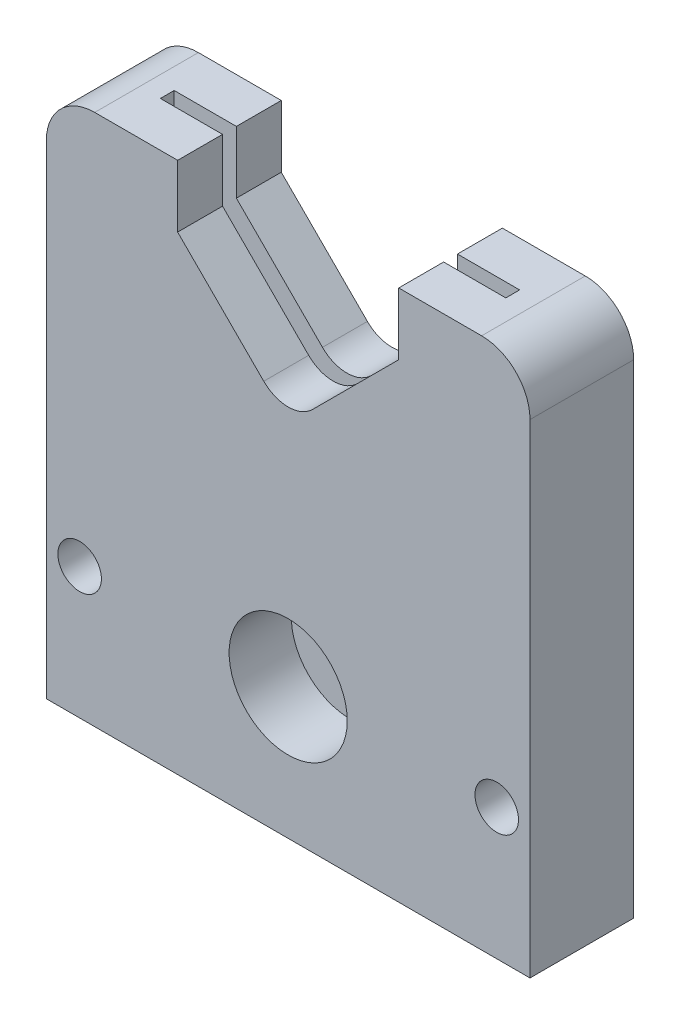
ISO-10303-21;
HEADER;
FILE_DESCRIPTION(('STEP AP214'),'2;1');
FILE_NAME('part.step','',(''),(''),'','','');
FILE_SCHEMA(('AUTOMOTIVE_DESIGN { 1 0 10303 214 1 1 1 1 }'));
ENDSEC;
DATA;
#1=APPLICATION_CONTEXT('core data for automotive mechanical design processes');
#2=APPLICATION_PROTOCOL_DEFINITION('international standard','automotive_design',2000,#1);
#3=PRODUCT_CONTEXT('',#1,'mechanical');
#4=PRODUCT('Part','Part','',(#3));
#5=PRODUCT_RELATED_PRODUCT_CATEGORY('part','',(#4));
#6=PRODUCT_DEFINITION_FORMATION('','',#4);
#7=PRODUCT_DEFINITION_CONTEXT('part definition',#1,'design');
#8=PRODUCT_DEFINITION('design','',#6,#7);
#9=PRODUCT_DEFINITION_SHAPE('','',#8);
#10=(LENGTH_UNIT() NAMED_UNIT(*) SI_UNIT(.MILLI.,.METRE.));
#11=(NAMED_UNIT(*) PLANE_ANGLE_UNIT() SI_UNIT($,.RADIAN.));
#12=(NAMED_UNIT(*) SI_UNIT($,.STERADIAN.) SOLID_ANGLE_UNIT());
#13=UNCERTAINTY_MEASURE_WITH_UNIT(LENGTH_MEASURE(1.E-05),#10,'distance_accuracy_value','');
#14=(GEOMETRIC_REPRESENTATION_CONTEXT(3) GLOBAL_UNCERTAINTY_ASSIGNED_CONTEXT((#13)) GLOBAL_UNIT_ASSIGNED_CONTEXT((#10,
#11,#12)) REPRESENTATION_CONTEXT('',''));
#15=CARTESIAN_POINT('',(0.,0.,0.));
#16=DIRECTION('',(0.,0.,1.));
#17=DIRECTION('',(1.,0.,0.));
#18=AXIS2_PLACEMENT_3D('',#15,#16,#17);
#19=CARTESIAN_POINT('',(51.,70.,140.15615246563));
#20=DIRECTION('',(-1.,0.,0.));
#21=DIRECTION('',(0.,0.,1.));
#22=AXIS2_PLACEMENT_3D('',#19,#20,#21);
#23=PLANE('',#22);
#24=DIRECTION('',(0.,-1.,0.));
#25=VECTOR('',#24,1.);
#26=CARTESIAN_POINT('',(51.,70.,6.50000000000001));
#27=LINE('',#26,#25);
#28=CARTESIAN_POINT('',(51.,70.,6.5));
#29=VERTEX_POINT('',#28);
#30=CARTESIAN_POINT('',(51.,61.,6.50000000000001));
#31=VERTEX_POINT('',#30);
#32=EDGE_CURVE('E265',#29,#31,#27,.T.);
#33=ORIENTED_EDGE('',*,*,#32,.F.);
#34=DIRECTION('',(0.,0.,-1.));
#35=VECTOR('',#34,1.);
#36=CARTESIAN_POINT('',(51.,70.,140.15615246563));
#37=LINE('',#36,#35);
#38=CARTESIAN_POINT('',(51.,70.,0.));
#39=VERTEX_POINT('',#38);
#40=EDGE_CURVE('E326',#29,#39,#37,.T.);
#41=ORIENTED_EDGE('',*,*,#40,.T.);
#42=DIRECTION('',(0.,-1.,0.));
#43=VECTOR('',#42,1.);
#44=CARTESIAN_POINT('',(51.,0.,0.));
#45=LINE('',#44,#43);
#46=CARTESIAN_POINT('',(51.,61.,0.));
#47=VERTEX_POINT('',#46);
#48=EDGE_CURVE('E412',#39,#47,#45,.T.);
#49=ORIENTED_EDGE('',*,*,#48,.T.);
#50=DIRECTION('',(0.,0.,-1.));
#51=VECTOR('',#50,1.);
#52=CARTESIAN_POINT('',(51.,61.,140.15615246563));
#53=LINE('',#52,#51);
#54=EDGE_CURVE('E321',#31,#47,#53,.T.);
#55=ORIENTED_EDGE('',*,*,#54,.F.);
#56=EDGE_LOOP('',(#33,#41,#49,#55));
#57=FACE_BOUND('',#56,.T.);
#58=ADVANCED_FACE('F41',(#57),#23,.T.);
#59=CARTESIAN_POINT('',(38.5355339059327,48.5355339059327,140.15615246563));
#60=DIRECTION('',(-0.707106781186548,0.707106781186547,0.));
#61=DIRECTION('',(-0.707106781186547,-0.707106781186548,0.));
#62=AXIS2_PLACEMENT_3D('',#59,#60,#61);
#63=PLANE('',#62);
#64=DIRECTION('',(-0.707106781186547,-0.707106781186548,0.));
#65=VECTOR('',#64,1.);
#66=CARTESIAN_POINT('',(38.5355339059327,48.5355339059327,6.50000000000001));
#67=LINE('',#66,#65);
#68=CARTESIAN_POINT('',(38.5355339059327,48.5355339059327,6.50000000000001));
#69=VERTEX_POINT('',#68);
#70=EDGE_CURVE('E262',#31,#69,#67,.T.);
#71=ORIENTED_EDGE('',*,*,#70,.F.);
#72=ORIENTED_EDGE('',*,*,#54,.T.);
#73=DIRECTION('',(-0.707106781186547,-0.707106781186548,0.));
#74=VECTOR('',#73,1.);
#75=CARTESIAN_POINT('',(-5.,4.99999999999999,0.));
#76=LINE('',#75,#74);
#77=CARTESIAN_POINT('',(38.5355339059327,48.5355339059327,0.));
#78=VERTEX_POINT('',#77);
#79=EDGE_CURVE('E408',#47,#78,#76,.T.);
#80=ORIENTED_EDGE('',*,*,#79,.T.);
#81=DIRECTION('',(0.,0.,-1.));
#82=VECTOR('',#81,1.);
#83=CARTESIAN_POINT('',(38.5355339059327,48.5355339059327,140.15615246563));
#84=LINE('',#83,#82);
#85=EDGE_CURVE('E316',#69,#78,#84,.T.);
#86=ORIENTED_EDGE('',*,*,#85,.F.);
#87=EDGE_LOOP('',(#71,#72,#80,#86));
#88=FACE_BOUND('',#87,.T.);
#89=ADVANCED_FACE('F473',(#88),#63,.T.);
#90=CARTESIAN_POINT('',(35.,52.0710678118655,140.15615246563));
#91=DIRECTION('',(0.,0.,-1.));
#92=DIRECTION('',(-1.,0.,0.));
#93=AXIS2_PLACEMENT_3D('',#90,#91,#92);
#94=CYLINDRICAL_SURFACE('',#93,5.);
#95=CARTESIAN_POINT('',(35.,52.0710678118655,6.50000000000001));
#96=DIRECTION('',(0.,0.,-1.));
#97=DIRECTION('',(-1.,0.,0.));
#98=AXIS2_PLACEMENT_3D('',#95,#96,#97);
#99=CIRCLE('',#98,5.);
#100=CARTESIAN_POINT('',(31.4644660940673,48.5355339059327,6.50000000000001));
#101=VERTEX_POINT('',#100);
#102=EDGE_CURVE('E259',#69,#101,#99,.T.);
#103=ORIENTED_EDGE('',*,*,#102,.F.);
#104=ORIENTED_EDGE('',*,*,#85,.T.);
#105=CARTESIAN_POINT('',(35.,52.0710678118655,0.));
#106=DIRECTION('',(0.,0.,1.));
#107=DIRECTION('',(1.,0.,0.));
#108=AXIS2_PLACEMENT_3D('',#105,#106,#107);
#109=CIRCLE('',#108,5.);
#110=CARTESIAN_POINT('',(31.4644660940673,48.5355339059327,0.));
#111=VERTEX_POINT('',#110);
#112=EDGE_CURVE('E404',#78,#111,#109,.F.);
#113=ORIENTED_EDGE('',*,*,#112,.T.);
#114=DIRECTION('',(0.,0.,-1.));
#115=VECTOR('',#114,1.);
#116=CARTESIAN_POINT('',(31.4644660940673,48.5355339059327,140.15615246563));
#117=LINE('',#116,#115);
#118=EDGE_CURVE('E311',#101,#111,#117,.T.);
#119=ORIENTED_EDGE('',*,*,#118,.F.);
#120=EDGE_LOOP('',(#103,#104,#113,#119));
#121=FACE_BOUND('',#120,.T.);
#122=ADVANCED_FACE('F469',(#121),#94,.F.);
#123=CARTESIAN_POINT('',(19.,61.,140.15615246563));
#124=DIRECTION('',(0.707106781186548,0.707106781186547,0.));
#125=DIRECTION('',(-0.707106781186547,0.707106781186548,0.));
#126=AXIS2_PLACEMENT_3D('',#123,#124,#125);
#127=PLANE('',#126);
#128=DIRECTION('',(-0.707106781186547,0.707106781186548,0.));
#129=VECTOR('',#128,1.);
#130=CARTESIAN_POINT('',(19.,61.,6.50000000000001));
#131=LINE('',#130,#129);
#132=CARTESIAN_POINT('',(19.,61.,6.50000000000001));
#133=VERTEX_POINT('',#132);
#134=EDGE_CURVE('E256',#101,#133,#131,.T.);
#135=ORIENTED_EDGE('',*,*,#134,.F.);
#136=ORIENTED_EDGE('',*,*,#118,.T.);
#137=DIRECTION('',(-0.707106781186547,0.707106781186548,0.));
#138=VECTOR('',#137,1.);
#139=CARTESIAN_POINT('',(40.,40.,0.));
#140=LINE('',#139,#138);
#141=CARTESIAN_POINT('',(19.,61.,0.));
#142=VERTEX_POINT('',#141);
#143=EDGE_CURVE('E400',#111,#142,#140,.T.);
#144=ORIENTED_EDGE('',*,*,#143,.T.);
#145=DIRECTION('',(0.,0.,-1.));
#146=VECTOR('',#145,1.);
#147=CARTESIAN_POINT('',(19.,61.,140.15615246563));
#148=LINE('',#147,#146);
#149=EDGE_CURVE('E305',#133,#142,#148,.T.);
#150=ORIENTED_EDGE('',*,*,#149,.F.);
#151=EDGE_LOOP('',(#135,#136,#144,#150));
#152=FACE_BOUND('',#151,.T.);
#153=ADVANCED_FACE('F463',(#152),#127,.T.);
#154=CARTESIAN_POINT('',(19.,70.,140.15615246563));
#155=DIRECTION('',(1.,0.,0.));
#156=DIRECTION('',(0.,0.,-1.));
#157=AXIS2_PLACEMENT_3D('',#154,#155,#156);
#158=PLANE('',#157);
#159=DIRECTION('',(0.,1.,0.));
#160=VECTOR('',#159,1.);
#161=CARTESIAN_POINT('',(19.,70.,6.50000000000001));
#162=LINE('',#161,#160);
#163=CARTESIAN_POINT('',(19.,70.,6.5));
#164=VERTEX_POINT('',#163);
#165=EDGE_CURVE('E11',#133,#164,#162,.T.);
#166=ORIENTED_EDGE('',*,*,#165,.F.);
#167=ORIENTED_EDGE('',*,*,#149,.T.);
#168=DIRECTION('',(0.,1.,0.));
#169=VECTOR('',#168,1.);
#170=CARTESIAN_POINT('',(19.,0.,0.));
#171=LINE('',#170,#169);
#172=CARTESIAN_POINT('',(19.,70.,0.));
#173=VERTEX_POINT('',#172);
#174=EDGE_CURVE('E396',#142,#173,#171,.T.);
#175=ORIENTED_EDGE('',*,*,#174,.T.);
#176=DIRECTION('',(0.,0.,-1.));
#177=VECTOR('',#176,1.);
#178=CARTESIAN_POINT('',(19.,70.,140.15615246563));
#179=LINE('',#178,#177);
#180=EDGE_CURVE('E306',#164,#173,#179,.T.);
#181=ORIENTED_EDGE('',*,*,#180,.F.);
#182=EDGE_LOOP('',(#166,#167,#175,#181));
#183=FACE_BOUND('',#182,.T.);
#184=ADVANCED_FACE('F459',(#183),#158,.T.);
#185=CARTESIAN_POINT('',(0.,70.,15.));
#186=DIRECTION('',(0.,-1.,0.));
#187=DIRECTION('',(0.,0.,-1.));
#188=AXIS2_PLACEMENT_3D('',#185,#186,#187);
#189=PLANE('',#188);
#190=ORIENTED_EDGE('',*,*,#40,.F.);
#191=DIRECTION('',(-1.,0.,0.));
#192=VECTOR('',#191,1.);
#193=CARTESIAN_POINT('',(60.,70.,6.5));
#194=LINE('',#193,#192);
#195=CARTESIAN_POINT('',(60.,70.,6.5));
#196=VERTEX_POINT('',#195);
#197=EDGE_CURVE('E217',#196,#29,#194,.T.);
#198=ORIENTED_EDGE('',*,*,#197,.F.);
#199=DIRECTION('',(0.,0.,-1.));
#200=VECTOR('',#199,1.);
#201=CARTESIAN_POINT('',(60.,70.,8.5));
#202=LINE('',#201,#200);
#203=CARTESIAN_POINT('',(60.,70.,8.5));
#204=VERTEX_POINT('',#203);
#205=EDGE_CURVE('E232',#204,#196,#202,.T.);
#206=ORIENTED_EDGE('',*,*,#205,.F.);
#207=DIRECTION('',(1.,0.,0.));
#208=VECTOR('',#207,1.);
#209=CARTESIAN_POINT('',(60.,70.,8.5));
#210=LINE('',#209,#208);
#211=CARTESIAN_POINT('',(51.,70.,8.5));
#212=VERTEX_POINT('',#211);
#213=EDGE_CURVE('E229',#212,#204,#210,.T.);
#214=ORIENTED_EDGE('',*,*,#213,.F.);
#215=CARTESIAN_POINT('',(51.,70.,15.));
#216=VERTEX_POINT('',#215);
#217=EDGE_CURVE('E327',#216,#212,#37,.T.);
#218=ORIENTED_EDGE('',*,*,#217,.F.);
#219=DIRECTION('',(-1.,0.,0.));
#220=VECTOR('',#219,1.);
#221=CARTESIAN_POINT('',(0.,70.,15.));
#222=LINE('',#221,#220);
#223=CARTESIAN_POINT('',(63.,70.,15.));
#224=VERTEX_POINT('',#223);
#225=EDGE_CURVE('E355',#224,#216,#222,.T.);
#226=ORIENTED_EDGE('',*,*,#225,.F.);
#227=DIRECTION('',(0.,0.,-1.));
#228=VECTOR('',#227,1.);
#229=CARTESIAN_POINT('',(63.,70.,15.));
#230=LINE('',#229,#228);
#231=CARTESIAN_POINT('',(63.,70.,0.));
#232=VERTEX_POINT('',#231);
#233=EDGE_CURVE('E358',#224,#232,#230,.T.);
#234=ORIENTED_EDGE('',*,*,#233,.T.);
#235=DIRECTION('',(-1.,0.,0.));
#236=VECTOR('',#235,1.);
#237=CARTESIAN_POINT('',(0.,70.,0.));
#238=LINE('',#237,#236);
#239=EDGE_CURVE('E350',#232,#39,#238,.T.);
#240=ORIENTED_EDGE('',*,*,#239,.T.);
#241=EDGE_LOOP('',(#190,#198,#206,#214,#218,#226,#234,#240));
#242=FACE_BOUND('',#241,.T.);
#243=ADVANCED_FACE('F481',(#242),#189,.F.);
#244=DIRECTION('',(0.,0.,1.));
#245=VECTOR('',#244,1.);
#246=CARTESIAN_POINT('',(10.,70.,8.5));
#247=LINE('',#246,#245);
#248=CARTESIAN_POINT('',(10.,70.,6.5));
#249=VERTEX_POINT('',#248);
#250=CARTESIAN_POINT('',(10.,70.,8.5));
#251=VERTEX_POINT('',#250);
#252=EDGE_CURVE('E199',#249,#251,#247,.T.);
#253=ORIENTED_EDGE('',*,*,#252,.F.);
#254=EDGE_CURVE('E220',#164,#249,#194,.T.);
#255=ORIENTED_EDGE('',*,*,#254,.F.);
#256=ORIENTED_EDGE('',*,*,#180,.T.);
#257=CARTESIAN_POINT('',(6.99999999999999,70.,0.));
#258=VERTEX_POINT('',#257);
#259=EDGE_CURVE('E365',#173,#258,#238,.T.);
#260=ORIENTED_EDGE('',*,*,#259,.T.);
#261=DIRECTION('',(0.,0.,-1.));
#262=VECTOR('',#261,1.);
#263=CARTESIAN_POINT('',(6.99999999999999,70.,15.));
#264=LINE('',#263,#262);
#265=CARTESIAN_POINT('',(6.99999999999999,70.,15.));
#266=VERTEX_POINT('',#265);
#267=EDGE_CURVE('E389',#258,#266,#264,.F.);
#268=ORIENTED_EDGE('',*,*,#267,.T.);
#269=CARTESIAN_POINT('',(19.,70.,15.));
#270=VERTEX_POINT('',#269);
#271=EDGE_CURVE('E354',#270,#266,#222,.T.);
#272=ORIENTED_EDGE('',*,*,#271,.F.);
#273=CARTESIAN_POINT('',(19.,70.,8.50000000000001));
#274=VERTEX_POINT('',#273);
#275=EDGE_CURVE('E301',#270,#274,#179,.T.);
#276=ORIENTED_EDGE('',*,*,#275,.T.);
#277=EDGE_CURVE('E57',#251,#274,#210,.T.);
#278=ORIENTED_EDGE('',*,*,#277,.F.);
#279=EDGE_LOOP('',(#253,#255,#256,#260,#268,#272,#276,#278));
#280=FACE_BOUND('',#279,.T.);
#281=ADVANCED_FACE('F437',(#280),#189,.F.);
#282=CARTESIAN_POINT('',(0.,0.,15.));
#283=DIRECTION('',(0.,0.,1.));
#284=DIRECTION('',(1.,0.,0.));
#285=AXIS2_PLACEMENT_3D('',#282,#283,#284);
#286=PLANE('',#285);
#287=CARTESIAN_POINT('',(35.,12.,15.));
#288=DIRECTION('',(0.,0.,1.));
#289=DIRECTION('',(1.,0.,0.));
#290=AXIS2_PLACEMENT_3D('',#287,#288,#289);
#291=CIRCLE('',#290,8.55);
#292=CARTESIAN_POINT('',(43.55,12.,15.));
#293=VERTEX_POINT('',#292);
#294=EDGE_CURVE('E284',#293,#293,#291,.T.);
#295=ORIENTED_EDGE('',*,*,#294,.F.);
#296=EDGE_LOOP('',(#295));
#297=FACE_BOUND('',#296,.T.);
#298=CARTESIAN_POINT('',(4.815,12.,15.));
#299=DIRECTION('',(0.,0.,1.));
#300=DIRECTION('',(1.,0.,0.));
#301=AXIS2_PLACEMENT_3D('',#298,#299,#300);
#302=CIRCLE('',#301,3.15);
#303=CARTESIAN_POINT('',(7.965,12.,15.));
#304=VERTEX_POINT('',#303);
#305=EDGE_CURVE('E293',#304,#304,#302,.T.);
#306=ORIENTED_EDGE('',*,*,#305,.F.);
#307=EDGE_LOOP('',(#306));
#308=FACE_BOUND('',#307,.T.);
#309=CARTESIAN_POINT('',(65.185,12.,15.));
#310=DIRECTION('',(0.,0.,1.));
#311=DIRECTION('',(1.,0.,0.));
#312=AXIS2_PLACEMENT_3D('',#309,#310,#311);
#313=CIRCLE('',#312,3.15);
#314=CARTESIAN_POINT('',(68.335,12.,15.));
#315=VERTEX_POINT('',#314);
#316=EDGE_CURVE('E289',#315,#315,#313,.T.);
#317=ORIENTED_EDGE('',*,*,#316,.F.);
#318=EDGE_LOOP('',(#317));
#319=FACE_BOUND('',#318,.T.);
#320=ORIENTED_EDGE('',*,*,#225,.T.);
#321=DIRECTION('',(0.,-1.,0.));
#322=VECTOR('',#321,1.);
#323=CARTESIAN_POINT('',(51.,0.,15.));
#324=LINE('',#323,#322);
#325=CARTESIAN_POINT('',(51.,61.,15.));
#326=VERTEX_POINT('',#325);
#327=EDGE_CURVE('E65',#216,#326,#324,.T.);
#328=ORIENTED_EDGE('',*,*,#327,.T.);
#329=DIRECTION('',(-0.707106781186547,-0.707106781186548,0.));
#330=VECTOR('',#329,1.);
#331=CARTESIAN_POINT('',(-5.,4.99999999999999,15.));
#332=LINE('',#331,#330);
#333=CARTESIAN_POINT('',(38.5355339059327,48.5355339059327,15.));
#334=VERTEX_POINT('',#333);
#335=EDGE_CURVE('E340',#326,#334,#332,.T.);
#336=ORIENTED_EDGE('',*,*,#335,.T.);
#337=CARTESIAN_POINT('',(35.,52.0710678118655,15.));
#338=DIRECTION('',(0.,0.,1.));
#339=DIRECTION('',(1.,0.,0.));
#340=AXIS2_PLACEMENT_3D('',#337,#338,#339);
#341=CIRCLE('',#340,5.);
#342=CARTESIAN_POINT('',(31.4644660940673,48.5355339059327,15.));
#343=VERTEX_POINT('',#342);
#344=EDGE_CURVE('E337',#334,#343,#341,.F.);
#345=ORIENTED_EDGE('',*,*,#344,.T.);
#346=DIRECTION('',(-0.707106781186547,0.707106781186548,0.));
#347=VECTOR('',#346,1.);
#348=CARTESIAN_POINT('',(40.,40.,15.));
#349=LINE('',#348,#347);
#350=CARTESIAN_POINT('',(19.,61.,15.));
#351=VERTEX_POINT('',#350);
#352=EDGE_CURVE('E334',#343,#351,#349,.T.);
#353=ORIENTED_EDGE('',*,*,#352,.T.);
#354=DIRECTION('',(0.,1.,0.));
#355=VECTOR('',#354,1.);
#356=CARTESIAN_POINT('',(19.,0.,15.));
#357=LINE('',#356,#355);
#358=EDGE_CURVE('E331',#351,#270,#357,.T.);
#359=ORIENTED_EDGE('',*,*,#358,.T.);
#360=ORIENTED_EDGE('',*,*,#271,.T.);
#361=CARTESIAN_POINT('',(6.99999999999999,63.,15.));
#362=DIRECTION('',(0.,0.,1.));
#363=DIRECTION('',(1.,0.,0.));
#364=AXIS2_PLACEMENT_3D('',#361,#362,#363);
#365=CIRCLE('',#364,7.);
#366=CARTESIAN_POINT('',(0.,63.,15.));
#367=VERTEX_POINT('',#366);
#368=EDGE_CURVE('E393',#266,#367,#365,.T.);
#369=ORIENTED_EDGE('',*,*,#368,.T.);
#370=DIRECTION('',(0.,-1.,0.));
#371=VECTOR('',#370,1.);
#372=CARTESIAN_POINT('',(0.,70.,15.));
#373=LINE('',#372,#371);
#374=CARTESIAN_POINT('',(0.,-7.,15.));
#375=VERTEX_POINT('',#374);
#376=EDGE_CURVE('E346',#367,#375,#373,.T.);
#377=ORIENTED_EDGE('',*,*,#376,.T.);
#378=DIRECTION('',(-1.,0.,0.));
#379=VECTOR('',#378,1.);
#380=CARTESIAN_POINT('',(0.,-7.,15.));
#381=LINE('',#380,#379);
#382=CARTESIAN_POINT('',(70.,-7.,15.));
#383=VERTEX_POINT('',#382);
#384=EDGE_CURVE('E280',#383,#375,#381,.T.);
#385=ORIENTED_EDGE('',*,*,#384,.F.);
#386=DIRECTION('',(0.,1.,0.));
#387=VECTOR('',#386,1.);
#388=CARTESIAN_POINT('',(70.,70.,15.));
#389=LINE('',#388,#387);
#390=CARTESIAN_POINT('',(70.,63.,15.));
#391=VERTEX_POINT('',#390);
#392=EDGE_CURVE('E349',#383,#391,#389,.T.);
#393=ORIENTED_EDGE('',*,*,#392,.T.);
#394=CARTESIAN_POINT('',(63.,63.,15.));
#395=DIRECTION('',(0.,0.,1.));
#396=DIRECTION('',(1.,0.,0.));
#397=AXIS2_PLACEMENT_3D('',#394,#395,#396);
#398=CIRCLE('',#397,7.);
#399=EDGE_CURVE('E378',#391,#224,#398,.T.);
#400=ORIENTED_EDGE('',*,*,#399,.T.);
#401=EDGE_LOOP('',(#320,#328,#336,#345,#353,#359,#360,#369,#377,#385,#393,#400));
#402=FACE_BOUND('',#401,.T.);
#403=ADVANCED_FACE('F435',(#297,#308,#319,#402),#286,.T.);
#404=CARTESIAN_POINT('',(0.,0.,0.));
#405=DIRECTION('',(0.,0.,1.));
#406=DIRECTION('',(1.,0.,0.));
#407=AXIS2_PLACEMENT_3D('',#404,#405,#406);
#408=PLANE('',#407);
#409=CARTESIAN_POINT('',(4.815,12.,0.));
#410=DIRECTION('',(0.,0.,1.));
#411=DIRECTION('',(1.,0.,0.));
#412=AXIS2_PLACEMENT_3D('',#409,#410,#411);
#413=CIRCLE('',#412,3.15);
#414=CARTESIAN_POINT('',(7.965,12.,0.));
#415=VERTEX_POINT('',#414);
#416=EDGE_CURVE('E419',#415,#415,#413,.T.);
#417=ORIENTED_EDGE('',*,*,#416,.T.);
#418=EDGE_LOOP('',(#417));
#419=FACE_BOUND('',#418,.T.);
#420=CARTESIAN_POINT('',(65.185,12.,0.));
#421=DIRECTION('',(0.,0.,1.));
#422=DIRECTION('',(1.,0.,0.));
#423=AXIS2_PLACEMENT_3D('',#420,#421,#422);
#424=CIRCLE('',#423,3.15);
#425=CARTESIAN_POINT('',(68.335,12.,0.));
#426=VERTEX_POINT('',#425);
#427=EDGE_CURVE('E297',#426,#426,#424,.T.);
#428=ORIENTED_EDGE('',*,*,#427,.T.);
#429=EDGE_LOOP('',(#428));
#430=FACE_BOUND('',#429,.T.);
#431=ORIENTED_EDGE('',*,*,#48,.F.);
#432=ORIENTED_EDGE('',*,*,#239,.F.);
#433=CARTESIAN_POINT('',(63.,63.,0.));
#434=DIRECTION('',(0.,0.,1.));
#435=DIRECTION('',(1.,0.,0.));
#436=AXIS2_PLACEMENT_3D('',#433,#434,#435);
#437=CIRCLE('',#436,7.);
#438=CARTESIAN_POINT('',(70.,63.,0.));
#439=VERTEX_POINT('',#438);
#440=EDGE_CURVE('E372',#232,#439,#437,.F.);
#441=ORIENTED_EDGE('',*,*,#440,.T.);
#442=DIRECTION('',(0.,1.,0.));
#443=VECTOR('',#442,1.);
#444=CARTESIAN_POINT('',(70.,70.,0.));
#445=LINE('',#444,#443);
#446=CARTESIAN_POINT('',(70.,-7.,0.));
#447=VERTEX_POINT('',#446);
#448=EDGE_CURVE('E361',#447,#439,#445,.T.);
#449=ORIENTED_EDGE('',*,*,#448,.F.);
#450=DIRECTION('',(1.,0.,0.));
#451=VECTOR('',#450,1.);
#452=CARTESIAN_POINT('',(0.,-7.,0.));
#453=LINE('',#452,#451);
#454=CARTESIAN_POINT('',(0.,-7.,0.));
#455=VERTEX_POINT('',#454);
#456=EDGE_CURVE('E272',#455,#447,#453,.T.);
#457=ORIENTED_EDGE('',*,*,#456,.F.);
#458=DIRECTION('',(0.,-1.,0.));
#459=VECTOR('',#458,1.);
#460=CARTESIAN_POINT('',(0.,70.,0.));
#461=LINE('',#460,#459);
#462=CARTESIAN_POINT('',(0.,63.,0.));
#463=VERTEX_POINT('',#462);
#464=EDGE_CURVE('E345',#463,#455,#461,.T.);
#465=ORIENTED_EDGE('',*,*,#464,.F.);
#466=CARTESIAN_POINT('',(6.99999999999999,63.,0.));
#467=DIRECTION('',(0.,0.,1.));
#468=DIRECTION('',(1.,0.,0.));
#469=AXIS2_PLACEMENT_3D('',#466,#467,#468);
#470=CIRCLE('',#469,7.);
#471=EDGE_CURVE('E385',#463,#258,#470,.F.);
#472=ORIENTED_EDGE('',*,*,#471,.T.);
#473=ORIENTED_EDGE('',*,*,#259,.F.);
#474=ORIENTED_EDGE('',*,*,#174,.F.);
#475=ORIENTED_EDGE('',*,*,#143,.F.);
#476=ORIENTED_EDGE('',*,*,#112,.F.);
#477=ORIENTED_EDGE('',*,*,#79,.F.);
#478=EDGE_LOOP('',(#431,#432,#441,#449,#457,#465,#472,#473,#474,#475,#476,#477));
#479=FACE_BOUND('',#478,.T.);
#480=ADVANCED_FACE('F456',(#419,#430,#479),#408,.F.);
#481=CARTESIAN_POINT('',(0.,70.,15.));
#482=DIRECTION('',(1.,0.,0.));
#483=DIRECTION('',(0.,1.,0.));
#484=AXIS2_PLACEMENT_3D('',#481,#482,#483);
#485=PLANE('',#484);
#486=ORIENTED_EDGE('',*,*,#376,.F.);
#487=DIRECTION('',(0.,0.,-1.));
#488=VECTOR('',#487,1.);
#489=CARTESIAN_POINT('',(0.,63.,15.));
#490=LINE('',#489,#488);
#491=EDGE_CURVE('E381',#367,#463,#490,.T.);
#492=ORIENTED_EDGE('',*,*,#491,.T.);
#493=ORIENTED_EDGE('',*,*,#464,.T.);
#494=DIRECTION('',(0.,0.,-1.));
#495=VECTOR('',#494,1.);
#496=CARTESIAN_POINT('',(0.,-7.,15.));
#497=LINE('',#496,#495);
#498=EDGE_CURVE('E268',#375,#455,#497,.T.);
#499=ORIENTED_EDGE('',*,*,#498,.F.);
#500=EDGE_LOOP('',(#486,#492,#493,#499));
#501=FACE_BOUND('',#500,.T.);
#502=ADVANCED_FACE('F542',(#501),#485,.F.);
#503=CARTESIAN_POINT('',(70.,70.,15.));
#504=DIRECTION('',(-1.,0.,0.));
#505=DIRECTION('',(0.,-1.,0.));
#506=AXIS2_PLACEMENT_3D('',#503,#504,#505);
#507=PLANE('',#506);
#508=ORIENTED_EDGE('',*,*,#448,.T.);
#509=DIRECTION('',(0.,0.,-1.));
#510=VECTOR('',#509,1.);
#511=CARTESIAN_POINT('',(70.,63.,15.));
#512=LINE('',#511,#510);
#513=EDGE_CURVE('E375',#439,#391,#512,.F.);
#514=ORIENTED_EDGE('',*,*,#513,.T.);
#515=ORIENTED_EDGE('',*,*,#392,.F.);
#516=DIRECTION('',(0.,0.,1.));
#517=VECTOR('',#516,1.);
#518=CARTESIAN_POINT('',(70.,-7.,15.));
#519=LINE('',#518,#517);
#520=EDGE_CURVE('E276',#447,#383,#519,.T.);
#521=ORIENTED_EDGE('',*,*,#520,.F.);
#522=EDGE_LOOP('',(#508,#514,#515,#521));
#523=FACE_BOUND('',#522,.T.);
#524=ADVANCED_FACE('F490',(#523),#507,.F.);
#525=CARTESIAN_POINT('',(63.,63.,15.));
#526=DIRECTION('',(0.,0.,-1.));
#527=DIRECTION('',(-1.,0.,0.));
#528=AXIS2_PLACEMENT_3D('',#525,#526,#527);
#529=CYLINDRICAL_SURFACE('',#528,7.);
#530=ORIENTED_EDGE('',*,*,#399,.F.);
#531=ORIENTED_EDGE('',*,*,#513,.F.);
#532=ORIENTED_EDGE('',*,*,#440,.F.);
#533=ORIENTED_EDGE('',*,*,#233,.F.);
#534=EDGE_LOOP('',(#530,#531,#532,#533));
#535=FACE_BOUND('',#534,.T.);
#536=ADVANCED_FACE('F492',(#535),#529,.T.);
#537=CARTESIAN_POINT('',(6.99999999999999,63.,15.));
#538=DIRECTION('',(0.,0.,-1.));
#539=DIRECTION('',(-1.,0.,0.));
#540=AXIS2_PLACEMENT_3D('',#537,#538,#539);
#541=CYLINDRICAL_SURFACE('',#540,7.);
#542=ORIENTED_EDGE('',*,*,#368,.F.);
#543=ORIENTED_EDGE('',*,*,#267,.F.);
#544=ORIENTED_EDGE('',*,*,#471,.F.);
#545=ORIENTED_EDGE('',*,*,#491,.F.);
#546=EDGE_LOOP('',(#542,#543,#544,#545));
#547=FACE_BOUND('',#546,.T.);
#548=ADVANCED_FACE('F43',(#547),#541,.T.);
#549=DIRECTION('',(0.,1.,0.));
#550=VECTOR('',#549,1.);
#551=CARTESIAN_POINT('',(51.,70.,8.50000000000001));
#552=LINE('',#551,#550);
#553=CARTESIAN_POINT('',(51.,61.,8.50000000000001));
#554=VERTEX_POINT('',#553);
#555=EDGE_CURVE('E253',#554,#212,#552,.T.);
#556=ORIENTED_EDGE('',*,*,#555,.F.);
#557=EDGE_CURVE('E322',#326,#554,#53,.T.);
#558=ORIENTED_EDGE('',*,*,#557,.F.);
#559=ORIENTED_EDGE('',*,*,#327,.F.);
#560=ORIENTED_EDGE('',*,*,#217,.T.);
#561=EDGE_LOOP('',(#556,#558,#559,#560));
#562=FACE_BOUND('',#561,.T.);
#563=ADVANCED_FACE('F497',(#562),#23,.T.);
#564=DIRECTION('',(0.707106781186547,0.707106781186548,0.));
#565=VECTOR('',#564,1.);
#566=CARTESIAN_POINT('',(38.5355339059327,48.5355339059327,8.50000000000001));
#567=LINE('',#566,#565);
#568=CARTESIAN_POINT('',(38.5355339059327,48.5355339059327,8.50000000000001));
#569=VERTEX_POINT('',#568);
#570=EDGE_CURVE('E250',#569,#554,#567,.T.);
#571=ORIENTED_EDGE('',*,*,#570,.F.);
#572=EDGE_CURVE('E317',#334,#569,#84,.T.);
#573=ORIENTED_EDGE('',*,*,#572,.F.);
#574=ORIENTED_EDGE('',*,*,#335,.F.);
#575=ORIENTED_EDGE('',*,*,#557,.T.);
#576=EDGE_LOOP('',(#571,#573,#574,#575));
#577=FACE_BOUND('',#576,.T.);
#578=ADVANCED_FACE('F501',(#577),#63,.T.);
#579=CARTESIAN_POINT('',(35.,52.0710678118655,8.50000000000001));
#580=DIRECTION('',(0.,0.,1.));
#581=DIRECTION('',(1.,0.,0.));
#582=AXIS2_PLACEMENT_3D('',#579,#580,#581);
#583=CIRCLE('',#582,5.);
#584=CARTESIAN_POINT('',(31.4644660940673,48.5355339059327,8.50000000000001));
#585=VERTEX_POINT('',#584);
#586=EDGE_CURVE('E247',#585,#569,#583,.T.);
#587=ORIENTED_EDGE('',*,*,#586,.F.);
#588=EDGE_CURVE('E312',#343,#585,#117,.T.);
#589=ORIENTED_EDGE('',*,*,#588,.F.);
#590=ORIENTED_EDGE('',*,*,#344,.F.);
#591=ORIENTED_EDGE('',*,*,#572,.T.);
#592=EDGE_LOOP('',(#587,#589,#590,#591));
#593=FACE_BOUND('',#592,.T.);
#594=ADVANCED_FACE('F505',(#593),#94,.F.);
#595=DIRECTION('',(0.707106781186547,-0.707106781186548,0.));
#596=VECTOR('',#595,1.);
#597=CARTESIAN_POINT('',(19.,61.,8.50000000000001));
#598=LINE('',#597,#596);
#599=CARTESIAN_POINT('',(19.,61.,8.50000000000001));
#600=VERTEX_POINT('',#599);
#601=EDGE_CURVE('E239',#600,#585,#598,.T.);
#602=ORIENTED_EDGE('',*,*,#601,.F.);
#603=EDGE_CURVE('E307',#351,#600,#148,.T.);
#604=ORIENTED_EDGE('',*,*,#603,.F.);
#605=ORIENTED_EDGE('',*,*,#352,.F.);
#606=ORIENTED_EDGE('',*,*,#588,.T.);
#607=EDGE_LOOP('',(#602,#604,#605,#606));
#608=FACE_BOUND('',#607,.T.);
#609=ADVANCED_FACE('F429',(#608),#127,.T.);
#610=DIRECTION('',(0.,-1.,0.));
#611=VECTOR('',#610,1.);
#612=CARTESIAN_POINT('',(19.,70.,8.50000000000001));
#613=LINE('',#612,#611);
#614=EDGE_CURVE('E50',#274,#600,#613,.T.);
#615=ORIENTED_EDGE('',*,*,#614,.F.);
#616=ORIENTED_EDGE('',*,*,#275,.F.);
#617=ORIENTED_EDGE('',*,*,#358,.F.);
#618=ORIENTED_EDGE('',*,*,#603,.T.);
#619=EDGE_LOOP('',(#615,#616,#617,#618));
#620=FACE_BOUND('',#619,.T.);
#621=ADVANCED_FACE('F433',(#620),#158,.T.);
#622=CARTESIAN_POINT('',(65.185,12.,-5.));
#623=DIRECTION('',(0.,0.,1.));
#624=DIRECTION('',(1.,0.,0.));
#625=AXIS2_PLACEMENT_3D('',#622,#623,#624);
#626=CYLINDRICAL_SURFACE('',#625,3.15);
#627=ORIENTED_EDGE('',*,*,#316,.T.);
#628=EDGE_LOOP('',(#627));
#629=FACE_BOUND('',#628,.T.);
#630=ORIENTED_EDGE('',*,*,#427,.F.);
#631=EDGE_LOOP('',(#630));
#632=FACE_BOUND('',#631,.T.);
#633=ADVANCED_FACE('F561',(#629,#632),#626,.F.);
#634=CARTESIAN_POINT('',(4.815,12.,-5.));
#635=DIRECTION('',(0.,0.,1.));
#636=DIRECTION('',(1.,0.,0.));
#637=AXIS2_PLACEMENT_3D('',#634,#635,#636);
#638=CYLINDRICAL_SURFACE('',#637,3.15);
#639=ORIENTED_EDGE('',*,*,#305,.T.);
#640=EDGE_LOOP('',(#639));
#641=FACE_BOUND('',#640,.T.);
#642=ORIENTED_EDGE('',*,*,#416,.F.);
#643=EDGE_LOOP('',(#642));
#644=FACE_BOUND('',#643,.T.);
#645=ADVANCED_FACE('F557',(#641,#644),#638,.F.);
#646=CARTESIAN_POINT('',(35.,12.,6.));
#647=DIRECTION('',(0.,0.,1.));
#648=DIRECTION('',(1.,0.,0.));
#649=AXIS2_PLACEMENT_3D('',#646,#647,#648);
#650=CYLINDRICAL_SURFACE('',#649,8.55);
#651=CARTESIAN_POINT('',(35.,12.,6.));
#652=DIRECTION('',(0.,0.,1.));
#653=DIRECTION('',(1.,0.,0.));
#654=AXIS2_PLACEMENT_3D('',#651,#652,#653);
#655=CIRCLE('',#654,8.55);
#656=CARTESIAN_POINT('',(43.55,12.,6.));
#657=VERTEX_POINT('',#656);
#658=EDGE_CURVE('E285',#657,#657,#655,.T.);
#659=ORIENTED_EDGE('',*,*,#658,.F.);
#660=EDGE_LOOP('',(#659));
#661=FACE_BOUND('',#660,.T.);
#662=ORIENTED_EDGE('',*,*,#294,.T.);
#663=EDGE_LOOP('',(#662));
#664=FACE_BOUND('',#663,.T.);
#665=ADVANCED_FACE('F550',(#661,#664),#650,.F.);
#666=CARTESIAN_POINT('',(35.,12.,6.));
#667=DIRECTION('',(0.,0.,1.));
#668=DIRECTION('',(1.,0.,0.));
#669=AXIS2_PLACEMENT_3D('',#666,#667,#668);
#670=PLANE('',#669);
#671=ORIENTED_EDGE('',*,*,#658,.T.);
#672=EDGE_LOOP('',(#671));
#673=FACE_BOUND('',#672,.T.);
#674=ADVANCED_FACE('F545',(#673),#670,.T.);
#675=CARTESIAN_POINT('',(0.,-7.,0.));
#676=DIRECTION('',(0.,-1.,0.));
#677=DIRECTION('',(0.,0.,-1.));
#678=AXIS2_PLACEMENT_3D('',#675,#676,#677);
#679=PLANE('',#678);
#680=ORIENTED_EDGE('',*,*,#498,.T.);
#681=ORIENTED_EDGE('',*,*,#456,.T.);
#682=ORIENTED_EDGE('',*,*,#520,.T.);
#683=ORIENTED_EDGE('',*,*,#384,.T.);
#684=EDGE_LOOP('',(#680,#681,#682,#683));
#685=FACE_BOUND('',#684,.T.);
#686=ADVANCED_FACE('F519',(#685),#679,.T.);
#687=CARTESIAN_POINT('',(10.,45.,8.5));
#688=DIRECTION('',(-1.,0.,0.));
#689=DIRECTION('',(0.,0.,1.));
#690=AXIS2_PLACEMENT_3D('',#687,#688,#689);
#691=PLANE('',#690);
#692=ORIENTED_EDGE('',*,*,#252,.T.);
#693=DIRECTION('',(0.,1.,0.));
#694=VECTOR('',#693,1.);
#695=CARTESIAN_POINT('',(10.,45.,8.5));
#696=LINE('',#695,#694);
#697=CARTESIAN_POINT('',(10.,45.,8.5));
#698=VERTEX_POINT('',#697);
#699=EDGE_CURVE('E191',#698,#251,#696,.T.);
#700=ORIENTED_EDGE('',*,*,#699,.F.);
#701=DIRECTION('',(0.,0.,1.));
#702=VECTOR('',#701,1.);
#703=CARTESIAN_POINT('',(10.,45.,8.5));
#704=LINE('',#703,#702);
#705=CARTESIAN_POINT('',(10.,45.,6.5));
#706=VERTEX_POINT('',#705);
#707=EDGE_CURVE('E196',#706,#698,#704,.T.);
#708=ORIENTED_EDGE('',*,*,#707,.F.);
#709=DIRECTION('',(0.,1.,0.));
#710=VECTOR('',#709,1.);
#711=CARTESIAN_POINT('',(10.,45.,6.5));
#712=LINE('',#711,#710);
#713=EDGE_CURVE('E236',#706,#249,#712,.T.);
#714=ORIENTED_EDGE('',*,*,#713,.T.);
#715=EDGE_LOOP('',(#692,#700,#708,#714));
#716=FACE_BOUND('',#715,.T.);
#717=ADVANCED_FACE('F193',(#716),#691,.F.);
#718=CARTESIAN_POINT('',(60.,45.,6.5));
#719=DIRECTION('',(0.,0.,-1.));
#720=DIRECTION('',(-1.,0.,0.));
#721=AXIS2_PLACEMENT_3D('',#718,#719,#720);
#722=PLANE('',#721);
#723=ORIENTED_EDGE('',*,*,#32,.T.);
#724=ORIENTED_EDGE('',*,*,#70,.T.);
#725=ORIENTED_EDGE('',*,*,#102,.T.);
#726=ORIENTED_EDGE('',*,*,#134,.T.);
#727=ORIENTED_EDGE('',*,*,#165,.T.);
#728=ORIENTED_EDGE('',*,*,#254,.T.);
#729=ORIENTED_EDGE('',*,*,#713,.F.);
#730=DIRECTION('',(-1.,0.,0.));
#731=VECTOR('',#730,1.);
#732=CARTESIAN_POINT('',(60.,45.,6.5));
#733=LINE('',#732,#731);
#734=CARTESIAN_POINT('',(60.,45.,6.5));
#735=VERTEX_POINT('',#734);
#736=EDGE_CURVE('E202',#735,#706,#733,.T.);
#737=ORIENTED_EDGE('',*,*,#736,.F.);
#738=DIRECTION('',(0.,1.,0.));
#739=VECTOR('',#738,1.);
#740=CARTESIAN_POINT('',(60.,45.,6.5));
#741=LINE('',#740,#739);
#742=EDGE_CURVE('E240',#735,#196,#741,.T.);
#743=ORIENTED_EDGE('',*,*,#742,.T.);
#744=ORIENTED_EDGE('',*,*,#197,.T.);
#745=EDGE_LOOP('',(#723,#724,#725,#726,#727,#728,#729,#737,#743,#744));
#746=FACE_BOUND('',#745,.T.);
#747=ADVANCED_FACE('F510',(#746),#722,.F.);
#748=CARTESIAN_POINT('',(60.,45.,8.5));
#749=DIRECTION('',(1.,0.,0.));
#750=DIRECTION('',(0.,0.,-1.));
#751=AXIS2_PLACEMENT_3D('',#748,#749,#750);
#752=PLANE('',#751);
#753=ORIENTED_EDGE('',*,*,#205,.T.);
#754=ORIENTED_EDGE('',*,*,#742,.F.);
#755=DIRECTION('',(0.,0.,-1.));
#756=VECTOR('',#755,1.);
#757=CARTESIAN_POINT('',(60.,45.,8.5));
#758=LINE('',#757,#756);
#759=CARTESIAN_POINT('',(60.,45.,8.5));
#760=VERTEX_POINT('',#759);
#761=EDGE_CURVE('E212',#760,#735,#758,.T.);
#762=ORIENTED_EDGE('',*,*,#761,.F.);
#763=DIRECTION('',(0.,1.,0.));
#764=VECTOR('',#763,1.);
#765=CARTESIAN_POINT('',(60.,45.,8.5));
#766=LINE('',#765,#764);
#767=EDGE_CURVE('E201',#760,#204,#766,.T.);
#768=ORIENTED_EDGE('',*,*,#767,.T.);
#769=EDGE_LOOP('',(#753,#754,#762,#768));
#770=FACE_BOUND('',#769,.T.);
#771=ADVANCED_FACE('F508',(#770),#752,.F.);
#772=CARTESIAN_POINT('',(60.,45.,8.5));
#773=DIRECTION('',(0.,0.,1.));
#774=DIRECTION('',(1.,0.,0.));
#775=AXIS2_PLACEMENT_3D('',#772,#773,#774);
#776=PLANE('',#775);
#777=ORIENTED_EDGE('',*,*,#555,.T.);
#778=ORIENTED_EDGE('',*,*,#213,.T.);
#779=ORIENTED_EDGE('',*,*,#767,.F.);
#780=DIRECTION('',(1.,0.,0.));
#781=VECTOR('',#780,1.);
#782=CARTESIAN_POINT('',(60.,45.,8.5));
#783=LINE('',#782,#781);
#784=EDGE_CURVE('E205',#698,#760,#783,.T.);
#785=ORIENTED_EDGE('',*,*,#784,.F.);
#786=ORIENTED_EDGE('',*,*,#699,.T.);
#787=ORIENTED_EDGE('',*,*,#277,.T.);
#788=ORIENTED_EDGE('',*,*,#614,.T.);
#789=ORIENTED_EDGE('',*,*,#601,.T.);
#790=ORIENTED_EDGE('',*,*,#586,.T.);
#791=ORIENTED_EDGE('',*,*,#570,.T.);
#792=EDGE_LOOP('',(#777,#778,#779,#785,#786,#787,#788,#789,#790,#791));
#793=FACE_BOUND('',#792,.T.);
#794=ADVANCED_FACE('F206',(#793),#776,.F.);
#795=CARTESIAN_POINT('',(0.,45.,0.));
#796=DIRECTION('',(0.,1.,0.));
#797=DIRECTION('',(0.,0.,1.));
#798=AXIS2_PLACEMENT_3D('',#795,#796,#797);
#799=PLANE('',#798);
#800=ORIENTED_EDGE('',*,*,#707,.T.);
#801=ORIENTED_EDGE('',*,*,#784,.T.);
#802=ORIENTED_EDGE('',*,*,#761,.T.);
#803=ORIENTED_EDGE('',*,*,#736,.T.);
#804=EDGE_LOOP('',(#800,#801,#802,#803));
#805=FACE_BOUND('',#804,.T.);
#806=ADVANCED_FACE('F214',(#805),#799,.T.);
#807=CLOSED_SHELL('',(#58,#89,#122,#153,#184,#243,#281,#403,#480,#502,#524,#536,#548,#563,#578,
#594,#609,#621,#633,#645,#665,#674,#686,#717,#747,#771,#794,#806));
#808=MANIFOLD_SOLID_BREP('B2',#807);
#809=ADVANCED_BREP_SHAPE_REPRESENTATION('',(#18,#808),#14);
#810=SHAPE_DEFINITION_REPRESENTATION(#9,#809);
ENDSEC;
END-ISO-10303-21;
